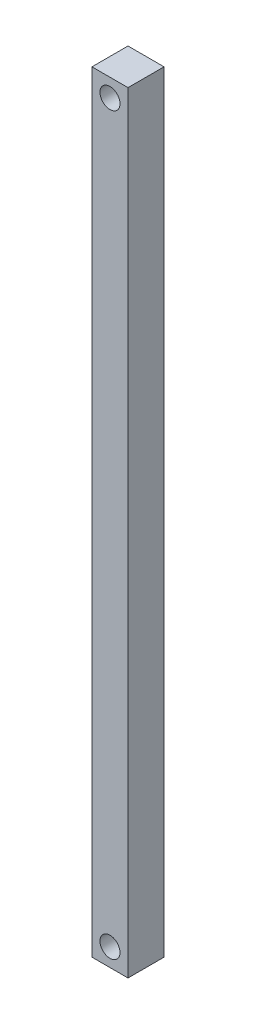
ISO-10303-21;
HEADER;
FILE_DESCRIPTION(('STEP AP214'),'2;1');
FILE_NAME('part.step','',(''),(''),'','','');
FILE_SCHEMA(('AUTOMOTIVE_DESIGN { 1 0 10303 214 1 1 1 1 }'));
ENDSEC;
DATA;
#1=APPLICATION_CONTEXT('core data for automotive mechanical design processes');
#2=APPLICATION_PROTOCOL_DEFINITION('international standard','automotive_design',2000,#1);
#3=PRODUCT_CONTEXT('',#1,'mechanical');
#4=PRODUCT('Part','Part','',(#3));
#5=PRODUCT_RELATED_PRODUCT_CATEGORY('part','',(#4));
#6=PRODUCT_DEFINITION_FORMATION('','',#4);
#7=PRODUCT_DEFINITION_CONTEXT('part definition',#1,'design');
#8=PRODUCT_DEFINITION('design','',#6,#7);
#9=PRODUCT_DEFINITION_SHAPE('','',#8);
#10=(LENGTH_UNIT() NAMED_UNIT(*) SI_UNIT(.MILLI.,.METRE.));
#11=(NAMED_UNIT(*) PLANE_ANGLE_UNIT() SI_UNIT($,.RADIAN.));
#12=(NAMED_UNIT(*) SI_UNIT($,.STERADIAN.) SOLID_ANGLE_UNIT());
#13=UNCERTAINTY_MEASURE_WITH_UNIT(LENGTH_MEASURE(1.E-05),#10,'distance_accuracy_value','');
#14=(GEOMETRIC_REPRESENTATION_CONTEXT(3) GLOBAL_UNCERTAINTY_ASSIGNED_CONTEXT((#13)) GLOBAL_UNIT_ASSIGNED_CONTEXT((#10,
#11,#12)) REPRESENTATION_CONTEXT('',''));
#15=CARTESIAN_POINT('',(0.,0.,0.));
#16=DIRECTION('',(0.,0.,1.));
#17=DIRECTION('',(1.,0.,0.));
#18=AXIS2_PLACEMENT_3D('',#15,#16,#17);
#19=CARTESIAN_POINT('',(0.,0.,18.7));
#20=DIRECTION('',(0.,0.,-1.));
#21=DIRECTION('',(-1.,0.,0.));
#22=AXIS2_PLACEMENT_3D('',#19,#20,#21);
#23=PLANE('',#22);
#24=DIRECTION('',(0.,-1.,0.));
#25=VECTOR('',#24,1.);
#26=CARTESIAN_POINT('',(-3.76965671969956,0.,18.7));
#27=LINE('',#26,#25);
#28=CARTESIAN_POINT('',(-3.76965671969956,400.,18.7));
#29=VERTEX_POINT('',#28);
#30=CARTESIAN_POINT('',(-3.76965671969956,0.,18.7));
#31=VERTEX_POINT('',#30);
#32=EDGE_CURVE('E98',#29,#31,#27,.T.);
#33=ORIENTED_EDGE('',*,*,#32,.T.);
#34=DIRECTION('',(1.,0.,0.));
#35=VECTOR('',#34,1.);
#36=CARTESIAN_POINT('',(-3.76965671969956,0.,18.7));
#37=LINE('',#36,#35);
#38=CARTESIAN_POINT('',(14.9303432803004,0.,18.7));
#39=VERTEX_POINT('',#38);
#40=EDGE_CURVE('E93',#31,#39,#37,.T.);
#41=ORIENTED_EDGE('',*,*,#40,.T.);
#42=DIRECTION('',(0.,1.,0.));
#43=VECTOR('',#42,1.);
#44=CARTESIAN_POINT('',(14.9303432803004,0.,18.7));
#45=LINE('',#44,#43);
#46=CARTESIAN_POINT('',(14.9303432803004,400.,18.7));
#47=VERTEX_POINT('',#46);
#48=EDGE_CURVE('E96',#39,#47,#45,.T.);
#49=ORIENTED_EDGE('',*,*,#48,.T.);
#50=DIRECTION('',(-1.,0.,0.));
#51=VECTOR('',#50,1.);
#52=CARTESIAN_POINT('',(-3.76965671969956,400.,18.7));
#53=LINE('',#52,#51);
#54=EDGE_CURVE('E63',#47,#29,#53,.T.);
#55=ORIENTED_EDGE('',*,*,#54,.T.);
#56=EDGE_LOOP('',(#33,#41,#49,#55));
#57=FACE_BOUND('',#56,.T.);
#58=CARTESIAN_POINT('',(5.58034328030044,390.65,18.7));
#59=DIRECTION('',(0.,0.,1.));
#60=DIRECTION('',(1.,0.,0.));
#61=AXIS2_PLACEMENT_3D('',#58,#59,#60);
#62=CIRCLE('',#61,5.19999999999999);
#63=CARTESIAN_POINT('',(10.7803432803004,390.65,18.7));
#64=VERTEX_POINT('',#63);
#65=EDGE_CURVE('E118',#64,#64,#62,.T.);
#66=ORIENTED_EDGE('',*,*,#65,.F.);
#67=EDGE_LOOP('',(#66));
#68=FACE_BOUND('',#67,.T.);
#69=CARTESIAN_POINT('',(5.58034328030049,9.35,18.7));
#70=DIRECTION('',(0.,0.,1.));
#71=DIRECTION('',(1.,0.,0.));
#72=AXIS2_PLACEMENT_3D('',#69,#70,#71);
#73=CIRCLE('',#72,5.2);
#74=CARTESIAN_POINT('',(10.7803432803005,9.35,18.7));
#75=VERTEX_POINT('',#74);
#76=EDGE_CURVE('E140',#75,#75,#73,.T.);
#77=ORIENTED_EDGE('',*,*,#76,.F.);
#78=EDGE_LOOP('',(#77));
#79=FACE_BOUND('',#78,.T.);
#80=ADVANCED_FACE('F45',(#57,#68,#79),#23,.F.);
#81=CARTESIAN_POINT('',(0.,0.,0.));
#82=DIRECTION('',(0.,0.,-1.));
#83=DIRECTION('',(-1.,0.,0.));
#84=AXIS2_PLACEMENT_3D('',#81,#82,#83);
#85=PLANE('',#84);
#86=CARTESIAN_POINT('',(5.58034328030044,390.65,0.));
#87=DIRECTION('',(0.,0.,1.));
#88=DIRECTION('',(1.,0.,0.));
#89=AXIS2_PLACEMENT_3D('',#86,#87,#88);
#90=CIRCLE('',#89,5.19999999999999);
#91=CARTESIAN_POINT('',(10.7803432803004,390.65,0.));
#92=VERTEX_POINT('',#91);
#93=EDGE_CURVE('E136',#92,#92,#90,.T.);
#94=ORIENTED_EDGE('',*,*,#93,.T.);
#95=EDGE_LOOP('',(#94));
#96=FACE_BOUND('',#95,.T.);
#97=DIRECTION('',(0.,-1.,0.));
#98=VECTOR('',#97,1.);
#99=CARTESIAN_POINT('',(-3.76965671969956,0.,0.));
#100=LINE('',#99,#98);
#101=CARTESIAN_POINT('',(-3.76965671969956,400.,0.));
#102=VERTEX_POINT('',#101);
#103=CARTESIAN_POINT('',(-3.76965671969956,0.,0.));
#104=VERTEX_POINT('',#103);
#105=EDGE_CURVE('E114',#102,#104,#100,.T.);
#106=ORIENTED_EDGE('',*,*,#105,.F.);
#107=DIRECTION('',(-1.,0.,0.));
#108=VECTOR('',#107,1.);
#109=CARTESIAN_POINT('',(-3.76965671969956,400.,0.));
#110=LINE('',#109,#108);
#111=CARTESIAN_POINT('',(14.9303432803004,400.,0.));
#112=VERTEX_POINT('',#111);
#113=EDGE_CURVE('E86',#112,#102,#110,.T.);
#114=ORIENTED_EDGE('',*,*,#113,.F.);
#115=DIRECTION('',(0.,1.,0.));
#116=VECTOR('',#115,1.);
#117=CARTESIAN_POINT('',(14.9303432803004,0.,0.));
#118=LINE('',#117,#116);
#119=CARTESIAN_POINT('',(14.9303432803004,0.,0.));
#120=VERTEX_POINT('',#119);
#121=EDGE_CURVE('E80',#120,#112,#118,.T.);
#122=ORIENTED_EDGE('',*,*,#121,.F.);
#123=DIRECTION('',(1.,0.,0.));
#124=VECTOR('',#123,1.);
#125=CARTESIAN_POINT('',(-3.76965671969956,0.,0.));
#126=LINE('',#125,#124);
#127=EDGE_CURVE('E103',#104,#120,#126,.T.);
#128=ORIENTED_EDGE('',*,*,#127,.F.);
#129=EDGE_LOOP('',(#106,#114,#122,#128));
#130=FACE_BOUND('',#129,.T.);
#131=CARTESIAN_POINT('',(5.58034328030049,9.35,0.));
#132=DIRECTION('',(0.,0.,1.));
#133=DIRECTION('',(1.,0.,0.));
#134=AXIS2_PLACEMENT_3D('',#131,#132,#133);
#135=CIRCLE('',#134,5.2);
#136=CARTESIAN_POINT('',(10.7803432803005,9.35,0.));
#137=VERTEX_POINT('',#136);
#138=EDGE_CURVE('E144',#137,#137,#135,.T.);
#139=ORIENTED_EDGE('',*,*,#138,.T.);
#140=EDGE_LOOP('',(#139));
#141=FACE_BOUND('',#140,.T.);
#142=ADVANCED_FACE('F131',(#96,#130,#141),#85,.T.);
#143=CARTESIAN_POINT('',(-3.76965671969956,0.,18.7));
#144=DIRECTION('',(1.,0.,0.));
#145=DIRECTION('',(0.,0.,-1.));
#146=AXIS2_PLACEMENT_3D('',#143,#144,#145);
#147=PLANE('',#146);
#148=ORIENTED_EDGE('',*,*,#105,.T.);
#149=DIRECTION('',(0.,0.,-1.));
#150=VECTOR('',#149,1.);
#151=CARTESIAN_POINT('',(-3.76965671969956,0.,18.7));
#152=LINE('',#151,#150);
#153=EDGE_CURVE('E11',#31,#104,#152,.T.);
#154=ORIENTED_EDGE('',*,*,#153,.F.);
#155=ORIENTED_EDGE('',*,*,#32,.F.);
#156=DIRECTION('',(0.,0.,-1.));
#157=VECTOR('',#156,1.);
#158=CARTESIAN_POINT('',(-3.76965671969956,400.,18.7));
#159=LINE('',#158,#157);
#160=EDGE_CURVE('E110',#29,#102,#159,.T.);
#161=ORIENTED_EDGE('',*,*,#160,.T.);
#162=EDGE_LOOP('',(#148,#154,#155,#161));
#163=FACE_BOUND('',#162,.T.);
#164=ADVANCED_FACE('F47',(#163),#147,.F.);
#165=CARTESIAN_POINT('',(-3.76965671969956,0.,18.7));
#166=DIRECTION('',(0.,1.,0.));
#167=DIRECTION('',(0.,0.,1.));
#168=AXIS2_PLACEMENT_3D('',#165,#166,#167);
#169=PLANE('',#168);
#170=ORIENTED_EDGE('',*,*,#127,.T.);
#171=DIRECTION('',(0.,0.,-1.));
#172=VECTOR('',#171,1.);
#173=CARTESIAN_POINT('',(14.9303432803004,0.,18.7));
#174=LINE('',#173,#172);
#175=EDGE_CURVE('E55',#39,#120,#174,.T.);
#176=ORIENTED_EDGE('',*,*,#175,.F.);
#177=ORIENTED_EDGE('',*,*,#40,.F.);
#178=ORIENTED_EDGE('',*,*,#153,.T.);
#179=EDGE_LOOP('',(#170,#176,#177,#178));
#180=FACE_BOUND('',#179,.T.);
#181=ADVANCED_FACE('F102',(#180),#169,.F.);
#182=CARTESIAN_POINT('',(14.9303432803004,0.,18.7));
#183=DIRECTION('',(-1.,0.,0.));
#184=DIRECTION('',(0.,0.,1.));
#185=AXIS2_PLACEMENT_3D('',#182,#183,#184);
#186=PLANE('',#185);
#187=ORIENTED_EDGE('',*,*,#121,.T.);
#188=DIRECTION('',(0.,0.,-1.));
#189=VECTOR('',#188,1.);
#190=CARTESIAN_POINT('',(14.9303432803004,400.,18.7));
#191=LINE('',#190,#189);
#192=EDGE_CURVE('E105',#47,#112,#191,.T.);
#193=ORIENTED_EDGE('',*,*,#192,.F.);
#194=ORIENTED_EDGE('',*,*,#48,.F.);
#195=ORIENTED_EDGE('',*,*,#175,.T.);
#196=EDGE_LOOP('',(#187,#193,#194,#195));
#197=FACE_BOUND('',#196,.T.);
#198=ADVANCED_FACE('F106',(#197),#186,.F.);
#199=CARTESIAN_POINT('',(-3.76965671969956,400.,18.7));
#200=DIRECTION('',(0.,-1.,0.));
#201=DIRECTION('',(0.,0.,-1.));
#202=AXIS2_PLACEMENT_3D('',#199,#200,#201);
#203=PLANE('',#202);
#204=ORIENTED_EDGE('',*,*,#113,.T.);
#205=ORIENTED_EDGE('',*,*,#160,.F.);
#206=ORIENTED_EDGE('',*,*,#54,.F.);
#207=ORIENTED_EDGE('',*,*,#192,.T.);
#208=EDGE_LOOP('',(#204,#205,#206,#207));
#209=FACE_BOUND('',#208,.T.);
#210=ADVANCED_FACE('F128',(#209),#203,.F.);
#211=CARTESIAN_POINT('',(5.58034328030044,390.65,18.7));
#212=DIRECTION('',(0.,0.,-1.));
#213=DIRECTION('',(-1.,0.,0.));
#214=AXIS2_PLACEMENT_3D('',#211,#212,#213);
#215=CYLINDRICAL_SURFACE('',#214,5.19999999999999);
#216=ORIENTED_EDGE('',*,*,#65,.T.);
#217=EDGE_LOOP('',(#216));
#218=FACE_BOUND('',#217,.T.);
#219=ORIENTED_EDGE('',*,*,#93,.F.);
#220=EDGE_LOOP('',(#219));
#221=FACE_BOUND('',#220,.T.);
#222=ADVANCED_FACE('F163',(#218,#221),#215,.F.);
#223=CARTESIAN_POINT('',(5.58034328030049,9.35,18.7));
#224=DIRECTION('',(0.,0.,-1.));
#225=DIRECTION('',(-1.,0.,0.));
#226=AXIS2_PLACEMENT_3D('',#223,#224,#225);
#227=CYLINDRICAL_SURFACE('',#226,5.2);
#228=ORIENTED_EDGE('',*,*,#76,.T.);
#229=EDGE_LOOP('',(#228));
#230=FACE_BOUND('',#229,.T.);
#231=ORIENTED_EDGE('',*,*,#138,.F.);
#232=EDGE_LOOP('',(#231));
#233=FACE_BOUND('',#232,.T.);
#234=ADVANCED_FACE('F152',(#230,#233),#227,.F.);
#235=CLOSED_SHELL('',(#80,#142,#164,#181,#198,#210,#222,#234));
#236=MANIFOLD_SOLID_BREP('B2',#235);
#237=ADVANCED_BREP_SHAPE_REPRESENTATION('',(#18,#236),#14);
#238=SHAPE_DEFINITION_REPRESENTATION(#9,#237);
ENDSEC;
END-ISO-10303-21;
